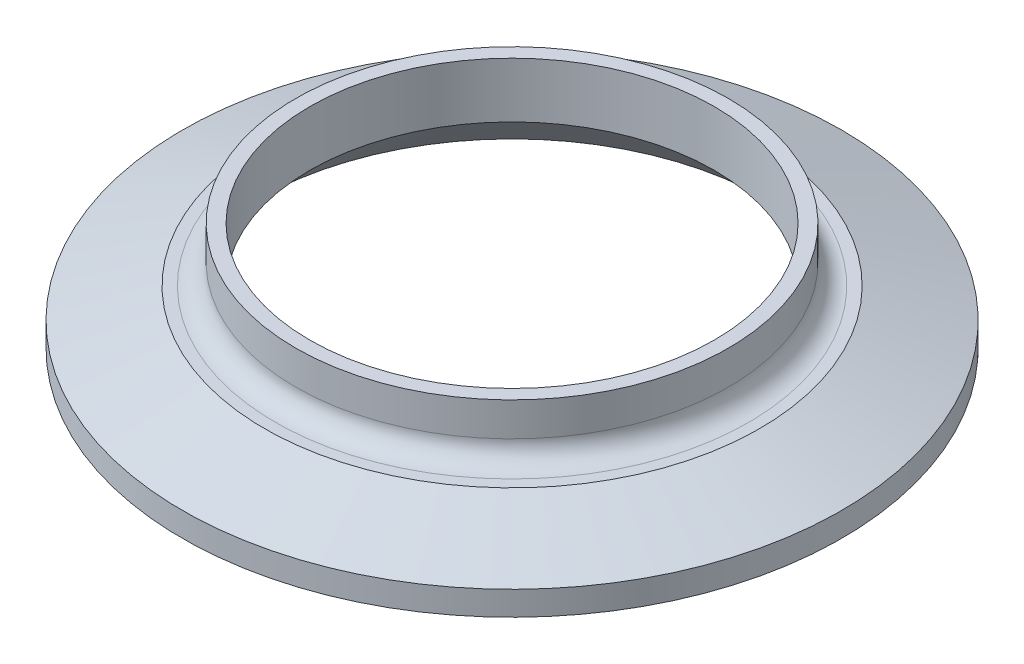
ISO-10303-21;
HEADER;
FILE_DESCRIPTION(('STEP AP214'),'2;1');
FILE_NAME('part.step','',(''),(''),'','','');
FILE_SCHEMA(('AUTOMOTIVE_DESIGN { 1 0 10303 214 1 1 1 1 }'));
ENDSEC;
DATA;
#1=APPLICATION_CONTEXT('core data for automotive mechanical design processes');
#2=APPLICATION_PROTOCOL_DEFINITION('international standard','automotive_design',2000,#1);
#3=PRODUCT_CONTEXT('',#1,'mechanical');
#4=PRODUCT('Part','Part','',(#3));
#5=PRODUCT_RELATED_PRODUCT_CATEGORY('part','',(#4));
#6=PRODUCT_DEFINITION_FORMATION('','',#4);
#7=PRODUCT_DEFINITION_CONTEXT('part definition',#1,'design');
#8=PRODUCT_DEFINITION('design','',#6,#7);
#9=PRODUCT_DEFINITION_SHAPE('','',#8);
#10=(LENGTH_UNIT() NAMED_UNIT(*) SI_UNIT(.MILLI.,.METRE.));
#11=(NAMED_UNIT(*) PLANE_ANGLE_UNIT() SI_UNIT($,.RADIAN.));
#12=(NAMED_UNIT(*) SI_UNIT($,.STERADIAN.) SOLID_ANGLE_UNIT());
#13=UNCERTAINTY_MEASURE_WITH_UNIT(LENGTH_MEASURE(1.E-05),#10,'distance_accuracy_value','');
#14=(GEOMETRIC_REPRESENTATION_CONTEXT(3) GLOBAL_UNCERTAINTY_ASSIGNED_CONTEXT((#13)) GLOBAL_UNIT_ASSIGNED_CONTEXT((#10,
#11,#12)) REPRESENTATION_CONTEXT('',''));
#15=CARTESIAN_POINT('',(0.,0.,0.));
#16=DIRECTION('',(0.,0.,1.));
#17=DIRECTION('',(1.,0.,0.));
#18=AXIS2_PLACEMENT_3D('',#15,#16,#17);
#19=CARTESIAN_POINT('',(-23.749,12.7,0.));
#20=DIRECTION('',(0.,-1.,0.));
#21=DIRECTION('',(0.,0.,-1.));
#22=AXIS2_PLACEMENT_3D('',#19,#20,#21);
#23=PLANE('',#22);
#24=CARTESIAN_POINT('',(0.,12.7,0.));
#25=DIRECTION('',(0.,-1.,0.));
#26=DIRECTION('',(0.,0.,-1.));
#27=AXIS2_PLACEMENT_3D('',#24,#25,#26);
#28=CIRCLE('',#27,25.4);
#29=CARTESIAN_POINT('',(0.,12.7,-25.4));
#30=VERTEX_POINT('',#29);
#31=EDGE_CURVE('E12',#30,#30,#28,.T.);
#32=ORIENTED_EDGE('',*,*,#31,.F.);
#33=EDGE_LOOP('',(#32));
#34=FACE_BOUND('',#33,.T.);
#35=CARTESIAN_POINT('',(0.,12.7,0.));
#36=DIRECTION('',(0.,-1.,0.));
#37=DIRECTION('',(0.,0.,-1.));
#38=AXIS2_PLACEMENT_3D('',#35,#36,#37);
#39=CIRCLE('',#38,23.749);
#40=CARTESIAN_POINT('',(0.,12.7,-23.749));
#41=VERTEX_POINT('',#40);
#42=EDGE_CURVE('E87',#41,#41,#39,.T.);
#43=ORIENTED_EDGE('',*,*,#42,.T.);
#44=EDGE_LOOP('',(#43));
#45=FACE_BOUND('',#44,.T.);
#46=ADVANCED_FACE('F38',(#34,#45),#23,.F.);
#47=CARTESIAN_POINT('',(0.,0.,0.));
#48=DIRECTION('',(0.,-1.,0.));
#49=DIRECTION('',(0.,0.,-1.));
#50=AXIS2_PLACEMENT_3D('',#47,#48,#49);
#51=CYLINDRICAL_SURFACE('',#50,25.4);
#52=CARTESIAN_POINT('',(0.,8.7376,0.));
#53=DIRECTION('',(0.,-1.,0.));
#54=DIRECTION('',(0.,0.,-1.));
#55=AXIS2_PLACEMENT_3D('',#52,#53,#54);
#56=CIRCLE('',#55,25.4);
#57=CARTESIAN_POINT('',(0.,8.7376,-25.4));
#58=VERTEX_POINT('',#57);
#59=EDGE_CURVE('E44',#58,#58,#56,.T.);
#60=ORIENTED_EDGE('',*,*,#59,.F.);
#61=EDGE_LOOP('',(#60));
#62=FACE_BOUND('',#61,.T.);
#63=ORIENTED_EDGE('',*,*,#31,.T.);
#64=EDGE_LOOP('',(#63));
#65=FACE_BOUND('',#64,.T.);
#66=ADVANCED_FACE('F166',(#62,#65),#51,.T.);
#67=CARTESIAN_POINT('',(0.,8.7376,0.));
#68=DIRECTION('',(0.,-1.,0.));
#69=DIRECTION('',(0.,0.,-1.));
#70=AXIS2_PLACEMENT_3D('',#67,#68,#69);
#71=TOROIDAL_SURFACE('',#70,27.7876,2.3876);
#72=CARTESIAN_POINT('',(0.,6.35,0.));
#73=DIRECTION('',(0.,-1.,0.));
#74=DIRECTION('',(0.,0.,-1.));
#75=AXIS2_PLACEMENT_3D('',#72,#73,#74);
#76=CIRCLE('',#75,27.7876);
#77=CARTESIAN_POINT('',(0.,6.35,-27.7876));
#78=VERTEX_POINT('',#77);
#79=EDGE_CURVE('E48',#78,#78,#76,.T.);
#80=ORIENTED_EDGE('',*,*,#79,.F.);
#81=EDGE_LOOP('',(#80));
#82=FACE_BOUND('',#81,.T.);
#83=ORIENTED_EDGE('',*,*,#59,.T.);
#84=EDGE_LOOP('',(#83));
#85=FACE_BOUND('',#84,.T.);
#86=ADVANCED_FACE('F161',(#82,#85),#71,.F.);
#87=CARTESIAN_POINT('',(-27.7876,6.35,0.));
#88=DIRECTION('',(0.,-1.,0.));
#89=DIRECTION('',(0.,0.,-1.));
#90=AXIS2_PLACEMENT_3D('',#87,#88,#89);
#91=PLANE('',#90);
#92=CARTESIAN_POINT('',(0.,6.35,0.));
#93=DIRECTION('',(0.,-1.,0.));
#94=DIRECTION('',(0.,0.,-1.));
#95=AXIS2_PLACEMENT_3D('',#92,#93,#94);
#96=CIRCLE('',#95,29.0664421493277);
#97=CARTESIAN_POINT('',(0.,6.35,-29.0664421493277));
#98=VERTEX_POINT('',#97);
#99=EDGE_CURVE('E52',#98,#98,#96,.T.);
#100=ORIENTED_EDGE('',*,*,#99,.F.);
#101=EDGE_LOOP('',(#100));
#102=FACE_BOUND('',#101,.T.);
#103=ORIENTED_EDGE('',*,*,#79,.T.);
#104=EDGE_LOOP('',(#103));
#105=FACE_BOUND('',#104,.T.);
#106=ADVANCED_FACE('F155',(#102,#105),#91,.F.);
#107=CARTESIAN_POINT('',(0.,6.35,0.));
#108=DIRECTION('',(0.,-1.,0.));
#109=DIRECTION('',(0.,0.,-1.));
#110=AXIS2_PLACEMENT_3D('',#107,#108,#109);
#111=CONICAL_SURFACE('',#110,29.0664421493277,1.22173047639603);
#112=CARTESIAN_POINT('',(0.,2.8448,0.));
#113=DIRECTION('',(0.,-1.,0.));
#114=DIRECTION('',(0.,0.,-1.));
#115=AXIS2_PLACEMENT_3D('',#112,#113,#114);
#116=CIRCLE('',#115,38.6969);
#117=CARTESIAN_POINT('',(0.,2.8448,-38.6969));
#118=VERTEX_POINT('',#117);
#119=EDGE_CURVE('E57',#118,#118,#116,.T.);
#120=ORIENTED_EDGE('',*,*,#119,.F.);
#121=EDGE_LOOP('',(#120));
#122=FACE_BOUND('',#121,.T.);
#123=ORIENTED_EDGE('',*,*,#99,.T.);
#124=EDGE_LOOP('',(#123));
#125=FACE_BOUND('',#124,.T.);
#126=ADVANCED_FACE('F149',(#122,#125),#111,.T.);
#127=CARTESIAN_POINT('',(0.,0.,0.));
#128=DIRECTION('',(0.,-1.,0.));
#129=DIRECTION('',(0.,0.,-1.));
#130=AXIS2_PLACEMENT_3D('',#127,#128,#129);
#131=CYLINDRICAL_SURFACE('',#130,38.6969);
#132=CARTESIAN_POINT('',(0.,0.,0.));
#133=DIRECTION('',(0.,-1.,0.));
#134=DIRECTION('',(0.,0.,-1.));
#135=AXIS2_PLACEMENT_3D('',#132,#133,#134);
#136=CIRCLE('',#135,38.6969);
#137=CARTESIAN_POINT('',(0.,0.,-38.6969));
#138=VERTEX_POINT('',#137);
#139=EDGE_CURVE('E60',#138,#138,#136,.T.);
#140=ORIENTED_EDGE('',*,*,#139,.F.);
#141=EDGE_LOOP('',(#140));
#142=FACE_BOUND('',#141,.T.);
#143=ORIENTED_EDGE('',*,*,#119,.T.);
#144=EDGE_LOOP('',(#143));
#145=FACE_BOUND('',#144,.T.);
#146=ADVANCED_FACE('F143',(#142,#145),#131,.T.);
#147=CARTESIAN_POINT('',(0.,0.,0.));
#148=DIRECTION('',(0.,-1.,0.));
#149=DIRECTION('',(0.,0.,-1.));
#150=AXIS2_PLACEMENT_3D('',#147,#148,#149);
#151=CONICAL_SURFACE('',#150,38.6969,1.56939586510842);
#152=CARTESIAN_POINT('',(0.,0.00251246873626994,0.));
#153=DIRECTION('',(0.,-1.,0.));
#154=DIRECTION('',(0.,0.,-1.));
#155=AXIS2_PLACEMENT_3D('',#152,#153,#154);
#156=CIRCLE('',#155,36.9028722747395);
#157=CARTESIAN_POINT('',(0.,0.00251246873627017,-36.9028722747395));
#158=VERTEX_POINT('',#157);
#159=EDGE_CURVE('E63',#158,#158,#156,.T.);
#160=ORIENTED_EDGE('',*,*,#159,.F.);
#161=EDGE_LOOP('',(#160));
#162=FACE_BOUND('',#161,.T.);
#163=ORIENTED_EDGE('',*,*,#139,.T.);
#164=EDGE_LOOP('',(#163));
#165=FACE_BOUND('',#164,.T.);
#166=ADVANCED_FACE('F137',(#162,#165),#151,.F.);
#167=CARTESIAN_POINT('',(0.,0.789912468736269,0.));
#168=DIRECTION('',(0.,-1.,0.));
#169=DIRECTION('',(0.,0.,-1.));
#170=AXIS2_PLACEMENT_3D('',#167,#168,#169);
#171=TOROIDAL_SURFACE('',#170,36.9028722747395,0.787400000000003);
#172=CARTESIAN_POINT('',(0.,0.482250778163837,0.));
#173=DIRECTION('',(0.,-1.,0.));
#174=DIRECTION('',(0.,0.,-1.));
#175=AXIS2_PLACEMENT_3D('',#172,#173,#174);
#176=CIRCLE('',#175,36.178066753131);
#177=CARTESIAN_POINT('',(0.,0.482250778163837,-36.178066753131));
#178=VERTEX_POINT('',#177);
#179=EDGE_CURVE('E66',#178,#178,#176,.T.);
#180=ORIENTED_EDGE('',*,*,#179,.F.);
#181=EDGE_LOOP('',(#180));
#182=FACE_BOUND('',#181,.T.);
#183=ORIENTED_EDGE('',*,*,#159,.T.);
#184=EDGE_LOOP('',(#183));
#185=FACE_BOUND('',#184,.T.);
#186=ADVANCED_FACE('F131',(#182,#185),#171,.T.);
#187=CARTESIAN_POINT('',(0.,0.482250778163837,0.));
#188=DIRECTION('',(0.,-1.,0.));
#189=DIRECTION('',(0.,0.,-1.));
#190=AXIS2_PLACEMENT_3D('',#187,#188,#189);
#191=CONICAL_SURFACE('',#190,36.178066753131,0.401425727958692);
#192=CARTESIAN_POINT('',(0.,0.729197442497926,0.));
#193=DIRECTION('',(0.,-1.,0.));
#194=DIRECTION('',(0.,0.,-1.));
#195=AXIS2_PLACEMENT_3D('',#192,#193,#194);
#196=CIRCLE('',#195,36.0732441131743);
#197=CARTESIAN_POINT('',(0.,0.729197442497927,-36.0732441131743));
#198=VERTEX_POINT('',#197);
#199=EDGE_CURVE('E69',#198,#198,#196,.T.);
#200=ORIENTED_EDGE('',*,*,#199,.F.);
#201=EDGE_LOOP('',(#200));
#202=FACE_BOUND('',#201,.T.);
#203=ORIENTED_EDGE('',*,*,#179,.T.);
#204=EDGE_LOOP('',(#203));
#205=FACE_BOUND('',#204,.T.);
#206=ADVANCED_FACE('F125',(#202,#205),#191,.F.);
#207=CARTESIAN_POINT('',(0.,0.408912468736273,0.));
#208=DIRECTION('',(0.,-1.,0.));
#209=DIRECTION('',(0.,0.,-1.));
#210=AXIS2_PLACEMENT_3D('',#207,#208,#209);
#211=TOROIDAL_SURFACE('',#210,35.3187,0.81970682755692);
#212=CARTESIAN_POINT('',(0.,0.729197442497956,0.));
#213=DIRECTION('',(0.,-1.,0.));
#214=DIRECTION('',(0.,0.,-1.));
#215=AXIS2_PLACEMENT_3D('',#212,#213,#214);
#216=CIRCLE('',#215,34.5641558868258);
#217=CARTESIAN_POINT('',(0.,0.729197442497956,-34.5641558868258));
#218=VERTEX_POINT('',#217);
#219=EDGE_CURVE('E72',#218,#218,#216,.T.);
#220=ORIENTED_EDGE('',*,*,#219,.F.);
#221=EDGE_LOOP('',(#220));
#222=FACE_BOUND('',#221,.T.);
#223=ORIENTED_EDGE('',*,*,#199,.T.);
#224=EDGE_LOOP('',(#223));
#225=FACE_BOUND('',#224,.T.);
#226=ADVANCED_FACE('F119',(#222,#225),#211,.F.);
#227=CARTESIAN_POINT('',(0.,0.729197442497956,0.));
#228=DIRECTION('',(0.,1.,0.));
#229=DIRECTION('',(0.,0.,1.));
#230=AXIS2_PLACEMENT_3D('',#227,#228,#229);
#231=CONICAL_SURFACE('',#230,34.5641558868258,0.401425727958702);
#232=CARTESIAN_POINT('',(0.,0.336080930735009,0.));
#233=DIRECTION('',(0.,-1.,0.));
#234=DIRECTION('',(0.,0.,-1.));
#235=AXIS2_PLACEMENT_3D('',#232,#233,#234);
#236=CIRCLE('',#235,34.3972878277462);
#237=CARTESIAN_POINT('',(0.,0.336080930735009,-34.3972878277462));
#238=VERTEX_POINT('',#237);
#239=EDGE_CURVE('E75',#238,#238,#236,.T.);
#240=ORIENTED_EDGE('',*,*,#239,.F.);
#241=EDGE_LOOP('',(#240));
#242=FACE_BOUND('',#241,.T.);
#243=ORIENTED_EDGE('',*,*,#219,.T.);
#244=EDGE_LOOP('',(#243));
#245=FACE_BOUND('',#244,.T.);
#246=ADVANCED_FACE('F113',(#242,#245),#231,.T.);
#247=CARTESIAN_POINT('',(0.,0.64374262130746,0.));
#248=DIRECTION('',(0.,-1.,0.));
#249=DIRECTION('',(0.,0.,-1.));
#250=AXIS2_PLACEMENT_3D('',#247,#248,#249);
#251=TOROIDAL_SURFACE('',#250,33.6724823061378,0.7874);
#252=CARTESIAN_POINT('',(0.,-0.143657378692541,0.));
#253=DIRECTION('',(0.,-1.,0.));
#254=DIRECTION('',(0.,0.,-1.));
#255=AXIS2_PLACEMENT_3D('',#252,#253,#254);
#256=CIRCLE('',#255,33.6724823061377);
#257=CARTESIAN_POINT('',(0.,-0.143657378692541,-33.6724823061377));
#258=VERTEX_POINT('',#257);
#259=EDGE_CURVE('E78',#258,#258,#256,.T.);
#260=ORIENTED_EDGE('',*,*,#259,.F.);
#261=EDGE_LOOP('',(#260));
#262=FACE_BOUND('',#261,.T.);
#263=ORIENTED_EDGE('',*,*,#239,.T.);
#264=EDGE_LOOP('',(#263));
#265=FACE_BOUND('',#264,.T.);
#266=ADVANCED_FACE('F107',(#262,#265),#251,.T.);
#267=CARTESIAN_POINT('',(0.,-0.143657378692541,0.));
#268=DIRECTION('',(0.,-1.,0.));
#269=DIRECTION('',(0.,0.,-1.));
#270=AXIS2_PLACEMENT_3D('',#267,#268,#269);
#271=CONICAL_SURFACE('',#270,33.6724823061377,1.53061701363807);
#272=CARTESIAN_POINT('',(0.,0.,0.));
#273=DIRECTION('',(0.,-1.,0.));
#274=DIRECTION('',(0.,0.,-1.));
#275=AXIS2_PLACEMENT_3D('',#272,#273,#274);
#276=CIRCLE('',#275,30.099);
#277=CARTESIAN_POINT('',(0.,0.,-30.099));
#278=VERTEX_POINT('',#277);
#279=EDGE_CURVE('E81',#278,#278,#276,.T.);
#280=ORIENTED_EDGE('',*,*,#279,.F.);
#281=EDGE_LOOP('',(#280));
#282=FACE_BOUND('',#281,.T.);
#283=ORIENTED_EDGE('',*,*,#259,.T.);
#284=EDGE_LOOP('',(#283));
#285=FACE_BOUND('',#284,.T.);
#286=ADVANCED_FACE('F101',(#282,#285),#271,.F.);
#287=CARTESIAN_POINT('',(0.,0.,0.));
#288=DIRECTION('',(0.,-1.,0.));
#289=DIRECTION('',(0.,0.,-1.));
#290=AXIS2_PLACEMENT_3D('',#287,#288,#289);
#291=CONICAL_SURFACE('',#290,30.099,0.795870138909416);
#292=CARTESIAN_POINT('',(0.,6.21837942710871,0.));
#293=DIRECTION('',(0.,-1.,0.));
#294=DIRECTION('',(0.,0.,-1.));
#295=AXIS2_PLACEMENT_3D('',#292,#293,#294);
#296=CIRCLE('',#295,23.749);
#297=CARTESIAN_POINT('',(0.,6.21837942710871,-23.749));
#298=VERTEX_POINT('',#297);
#299=EDGE_CURVE('E84',#298,#298,#296,.T.);
#300=ORIENTED_EDGE('',*,*,#299,.F.);
#301=EDGE_LOOP('',(#300));
#302=FACE_BOUND('',#301,.T.);
#303=ORIENTED_EDGE('',*,*,#279,.T.);
#304=EDGE_LOOP('',(#303));
#305=FACE_BOUND('',#304,.T.);
#306=ADVANCED_FACE('F95',(#302,#305),#291,.F.);
#307=CARTESIAN_POINT('',(0.,0.,0.));
#308=DIRECTION('',(0.,-1.,0.));
#309=DIRECTION('',(0.,0.,-1.));
#310=AXIS2_PLACEMENT_3D('',#307,#308,#309);
#311=CYLINDRICAL_SURFACE('',#310,23.749);
#312=ORIENTED_EDGE('',*,*,#42,.F.);
#313=EDGE_LOOP('',(#312));
#314=FACE_BOUND('',#313,.T.);
#315=ORIENTED_EDGE('',*,*,#299,.T.);
#316=EDGE_LOOP('',(#315));
#317=FACE_BOUND('',#316,.T.);
#318=ADVANCED_FACE('F92',(#314,#317),#311,.F.);
#319=CLOSED_SHELL('',(#46,#66,#86,#106,#126,#146,#166,#186,#206,#226,#246,#266,#286,#306,#318));
#320=MANIFOLD_SOLID_BREP('B2',#319);
#321=ADVANCED_BREP_SHAPE_REPRESENTATION('',(#18,#320),#14);
#322=SHAPE_DEFINITION_REPRESENTATION(#9,#321);
ENDSEC;
END-ISO-10303-21;
